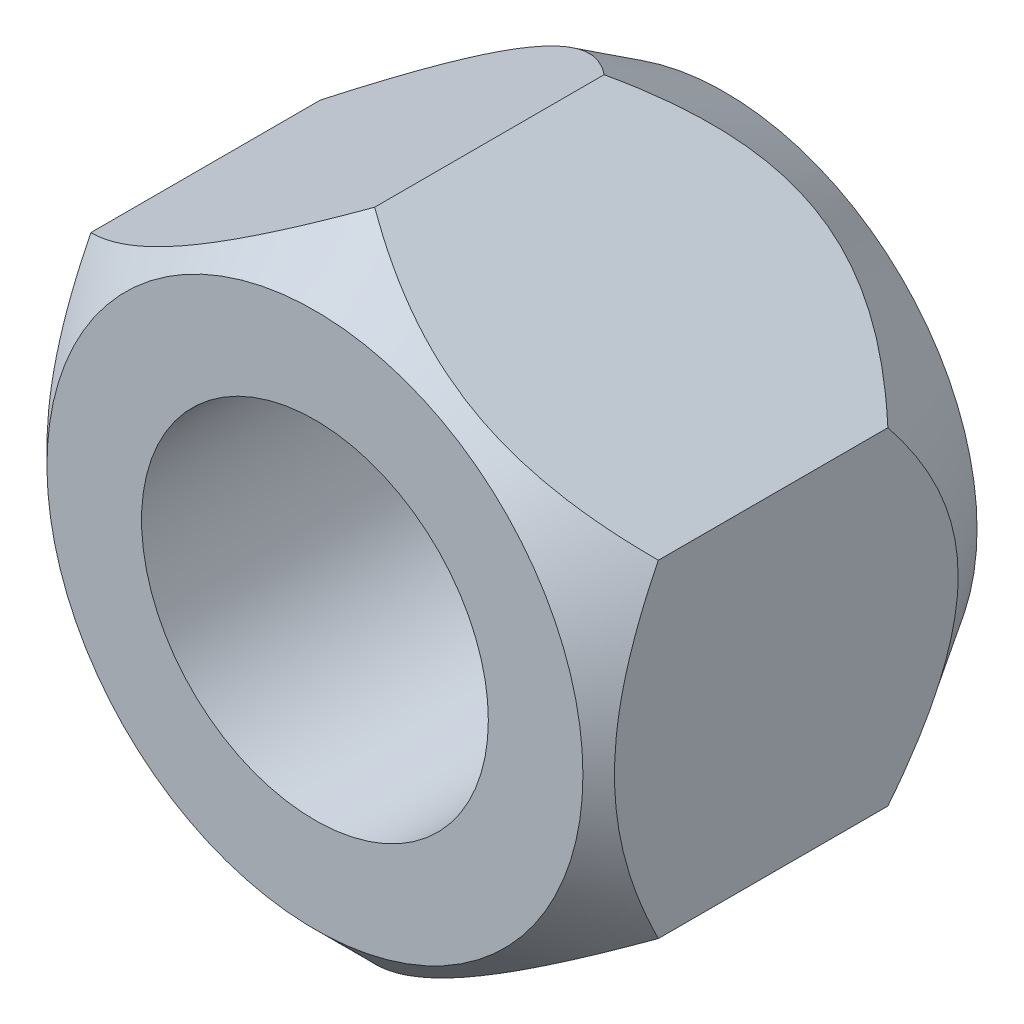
from build123d import *

# Parameters (mm, degrees)
EXTRUDE1_DEPTH          = 10.31875
F_3_4_16_TAPPED_HOLE1_D = 17.4625
HOLE1_D                 = 19.177
HOLE1_DEPTH             = 7.9375


with BuildPart() as part:
    # Sketch1 → Extrude1 (new, symmetric)
    with BuildSketch(Plane.XY):
        Polygon((0, 16.497783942), (-14.2875, 8.248891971), (-14.2875, -8.248891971), (0, -16.497783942), (14.2875, -8.248891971), (14.2875, 8.248891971), align=None)
    extrude(amount=EXTRUDE1_DEPTH, both=True)

    # Sketch2 → Cut-Revolve1 (revolve, cut)
    with BuildSketch(Plane(origin=(0, 0, 0), x_dir=(0, 0, -1), z_dir=(1, 0, 0)), mode=Mode.PRIVATE) as cut_revolve1_sk:
        Polygon((-7.314716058, 16.497783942), (-10.31875, 13.49375), (-10.31875, 16.497783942), align=None)
        Polygon((10.31875, 12.7), (4.241025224, 16.497783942), (10.31875, 16.497783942), align=None)
    revolve(cut_revolve1_sk.sketch.rotate(Axis((0, 0, 17.5827984), (0, 0, -1)), 300.000000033), axis=Axis((0, 0, 17.5827984), (0, 0, -1)), mode=Mode.SUBTRACT)

    # 3_4-16 Tapped Hole1 (through all)
    with Locations(Plane.XY.offset(10.31875)):
        with Locations((0, 0)):
            Hole(F_3_4_16_TAPPED_HOLE1_D / 2)

    # Hole1
    with Locations(Plane(origin=(0, 0, -10.31875), x_dir=(-1, 0, 0), z_dir=(0, 0, -1))):
        with Locations((0, 0)):
            Hole(HOLE1_D / 2, depth=HOLE1_DEPTH)


solid = part.part
